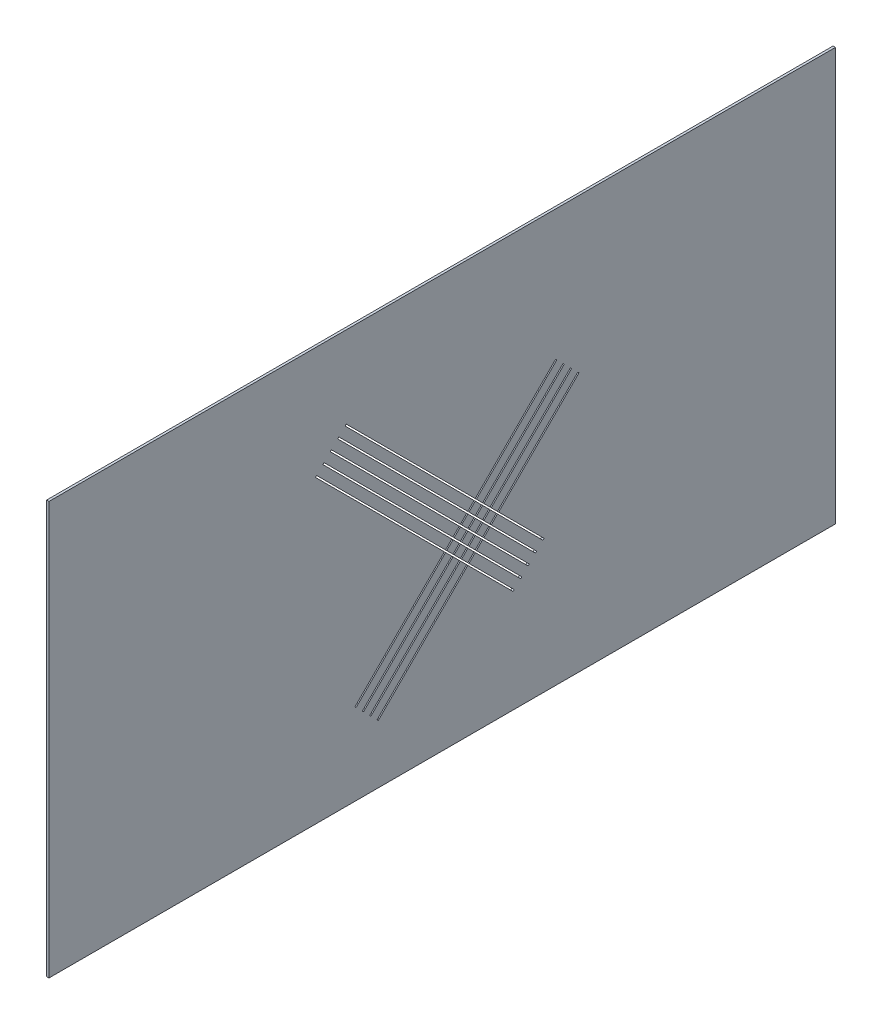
from build123d import *

# Parameters (mm, degrees)
SKETCH1_W         = 1009.65
SKETCH1_H         = 529.844
EXTRUDE3_DEPTH    = 3.048
EXTRUDE3_2_DEPTH  = 3.048
EXTRUDE3_3_DEPTH  = 3.048
EXTRUDE3_4_DEPTH  = 3.048
EXTRUDE3_5_DEPTH  = 3.048
EXTRUDE3_6_DEPTH  = 3.048
EXTRUDE3_7_DEPTH  = 3.048
EXTRUDE3_8_DEPTH  = 3.048
EXTRUDE3_9_DEPTH  = 3.048
EXTRUDE3_10_DEPTH = 3.048
EXTRUDE3_11_DEPTH = 3.048
EXTRUDE3_12_DEPTH = 3.048
EXTRUDE3_13_DEPTH = 3.048


with BuildPart() as part:
    # Sketch1 → Extrude3 (new body)
    with BuildSketch(Plane(origin=(0, 0, 0), x_dir=(0, 0, -1), z_dir=(1, 0, 0))):
        with Locations((504.825, 264.922)):
            Rectangle(SKETCH1_W, SKETCH1_H)
        Polygon((545.794849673, 257.987609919), (380.188819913, 423.593639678), (381.625660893, 425.030480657), (547.231690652, 259.424450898), (650.442750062, 362.635510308), (651.879591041, 361.198669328), (548.668531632, 257.987609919), (556.75076214, 249.90537941), (659.96182155, 353.116438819), (661.39866253, 351.67959784), (558.18760312, 248.46853843), (566.269833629, 240.386307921), (669.480893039, 343.597367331), (670.917734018, 342.160526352), (567.706674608, 238.949466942), (575.788905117, 230.867236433), (678.999964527, 334.078295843), (680.436805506, 332.641454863), (577.225746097, 229.430395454), (635.595845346, 171.060296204), (634.159004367, 169.623455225), (575.788905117, 227.993554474), (567.706674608, 219.911323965), (626.076773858, 161.541224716), (624.639932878, 160.104383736), (566.269833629, 218.474482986), (558.18760312, 210.392252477), (616.557702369, 152.022153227), (615.12086139, 150.585312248), (556.750762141, 208.955411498), (548.668531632, 200.873180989), (607.038630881, 142.503081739), (605.601789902, 141.06624076), (547.231690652, 199.436340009), (539.149460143, 191.3541095), (597.255530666, 133.248038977), (595.818689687, 131.811197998), (537.712619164, 189.917268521), (422.787356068, 74.992005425), (421.350515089, 76.428846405), (536.275778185, 191.3541095), (528.193547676, 199.436340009), (413.26828458, 84.511076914), (411.831443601, 85.947917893), (526.756706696, 200.873180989), (518.674476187, 208.955411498), (403.749213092, 94.030148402), (402.312372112, 95.466989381), (517.237635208, 210.392252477), (509.155404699, 218.474482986), (394.230141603, 103.54921989), (392.793300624, 104.98606087), (507.718563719, 219.911323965), (342.11253396, 385.517353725), (343.549374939, 386.954194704), (509.155404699, 221.348164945), (517.237635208, 229.430395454), (351.631605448, 395.036425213), (353.068446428, 396.473266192), (518.674476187, 230.867236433), (526.756706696, 238.949466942), (361.150676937, 404.555496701), (362.587517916, 405.992337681), (528.193547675, 240.386307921), (536.275778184, 248.46853843), (370.669748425, 414.07456819), (372.106589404, 415.511409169), (537.712619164, 249.90537941), align=None, mode=Mode.SUBTRACT)
    extrude(amount=EXTRUDE3_DEPTH)


with BuildPart() as body_2:
    # Sketch1 → Extrude3 2 (new body)
    with BuildSketch(Plane(origin=(0, 0, 0), x_dir=(0, 0, -1), z_dir=(1, 0, 0))):
        Polygon((556.750762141, 247.031697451), (548.668531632, 238.949466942), (556.750762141, 230.867236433), (564.83299265, 238.949466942), align=None)
    extrude(amount=EXTRUDE3_2_DEPTH)


with BuildPart() as body_3:
    # Sketch1 → Extrude3 3 (new body)
    with BuildSketch(Plane(origin=(0, 0, 0), x_dir=(0, 0, -1), z_dir=(1, 0, 0))):
        Polygon((539.149460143, 248.46853843), (547.231690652, 240.386307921), (555.313921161, 248.46853843), (547.231690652, 256.550768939), align=None)
    extrude(amount=EXTRUDE3_3_DEPTH)


with BuildPart() as body_4:
    # Sketch1 → Extrude3 4 (new body)
    with BuildSketch(Plane(origin=(0, 0, 0), x_dir=(0, 0, -1), z_dir=(1, 0, 0))):
        Polygon((555.313921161, 229.430395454), (547.231690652, 237.512625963), (539.149460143, 229.430395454), (547.231690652, 221.348164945), align=None)
    extrude(amount=EXTRUDE3_4_DEPTH)


with BuildPart() as body_5:
    # Sketch1 → Extrude3 5 (new body)
    with BuildSketch(Plane(origin=(0, 0, 0), x_dir=(0, 0, -1), z_dir=(1, 0, 0))):
        Polygon((529.630388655, 238.949466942), (537.712619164, 230.867236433), (545.794849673, 238.949466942), (537.712619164, 247.031697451), align=None)
    extrude(amount=EXTRUDE3_5_DEPTH)


with BuildPart() as body_6:
    # Sketch1 → Extrude3 6 (new body)
    with BuildSketch(Plane(origin=(0, 0, 0), x_dir=(0, 0, -1), z_dir=(1, 0, 0))):
        Polygon((574.352064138, 229.430395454), (566.269833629, 237.512625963), (558.18760312, 229.430395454), (566.269833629, 221.348164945), align=None)
    extrude(amount=EXTRUDE3_6_DEPTH)


with BuildPart() as body_7:
    # Sketch1 → Extrude3 7 (new body)
    with BuildSketch(Plane(origin=(0, 0, 0), x_dir=(0, 0, -1), z_dir=(1, 0, 0))):
        Polygon((518.674476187, 227.993554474), (510.586311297, 219.905389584), (518.668541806, 211.823159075), (526.756706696, 219.911323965), align=None)
    extrude(amount=EXTRUDE3_7_DEPTH)


with BuildPart() as body_8:
    # Sketch1 → Extrude3 8 (new body)
    with BuildSketch(Plane(origin=(0, 0, 0), x_dir=(0, 0, -1), z_dir=(1, 0, 0))):
        Polygon((528.193547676, 237.512625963), (520.111317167, 229.430395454), (528.193547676, 221.348164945), (536.275778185, 229.430395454), align=None)
    extrude(amount=EXTRUDE3_8_DEPTH)


with BuildPart() as body_9:
    # Sketch1 → Extrude3 9 (new body)
    with BuildSketch(Plane(origin=(0, 0, 0), x_dir=(0, 0, -1), z_dir=(1, 0, 0))):
        Polygon((528.193547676, 218.474482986), (520.111317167, 210.392252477), (528.193547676, 202.310021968), (536.275778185, 210.392252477), align=None)
    extrude(amount=EXTRUDE3_9_DEPTH)


with BuildPart() as body_10:
    # Sketch1 → Extrude3 10 (new body)
    with BuildSketch(Plane(origin=(0, 0, 0), x_dir=(0, 0, -1), z_dir=(1, 0, 0))):
        Polygon((556.750762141, 227.993554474), (548.668531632, 219.911323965), (556.750762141, 211.829093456), (564.83299265, 219.911323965), align=None)
    extrude(amount=EXTRUDE3_10_DEPTH)


with BuildPart() as body_11:
    # Sketch1 → Extrude3 11 (new body)
    with BuildSketch(Plane(origin=(0, 0, 0), x_dir=(0, 0, -1), z_dir=(1, 0, 0))):
        Polygon((545.794849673, 219.911323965), (537.712619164, 227.993554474), (529.630388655, 219.911323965), (537.712619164, 211.829093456), align=None)
    extrude(amount=EXTRUDE3_11_DEPTH)


with BuildPart() as body_12:
    # Sketch1 → Extrude3 12 (new body)
    with BuildSketch(Plane(origin=(0, 0, 0), x_dir=(0, 0, -1), z_dir=(1, 0, 0))):
        Polygon((555.313921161, 210.392252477), (547.231690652, 218.474482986), (539.149460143, 210.392252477), (547.231690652, 202.310021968), align=None)
    extrude(amount=EXTRUDE3_12_DEPTH)


with BuildPart() as body_13:
    # Sketch1 → Extrude3 13 (new body)
    with BuildSketch(Plane(origin=(0, 0, 0), x_dir=(0, 0, -1), z_dir=(1, 0, 0))):
        Polygon((545.794849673, 200.873180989), (537.712619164, 208.955411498), (529.630388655, 200.873180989), (537.712619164, 192.79095048), align=None)
    extrude(amount=EXTRUDE3_13_DEPTH)


solid = Compound([part.part, body_2.part, body_3.part, body_4.part, body_5.part, body_6.part, body_7.part, body_8.part, body_9.part, body_10.part, body_11.part, body_12.part, body_13.part])
